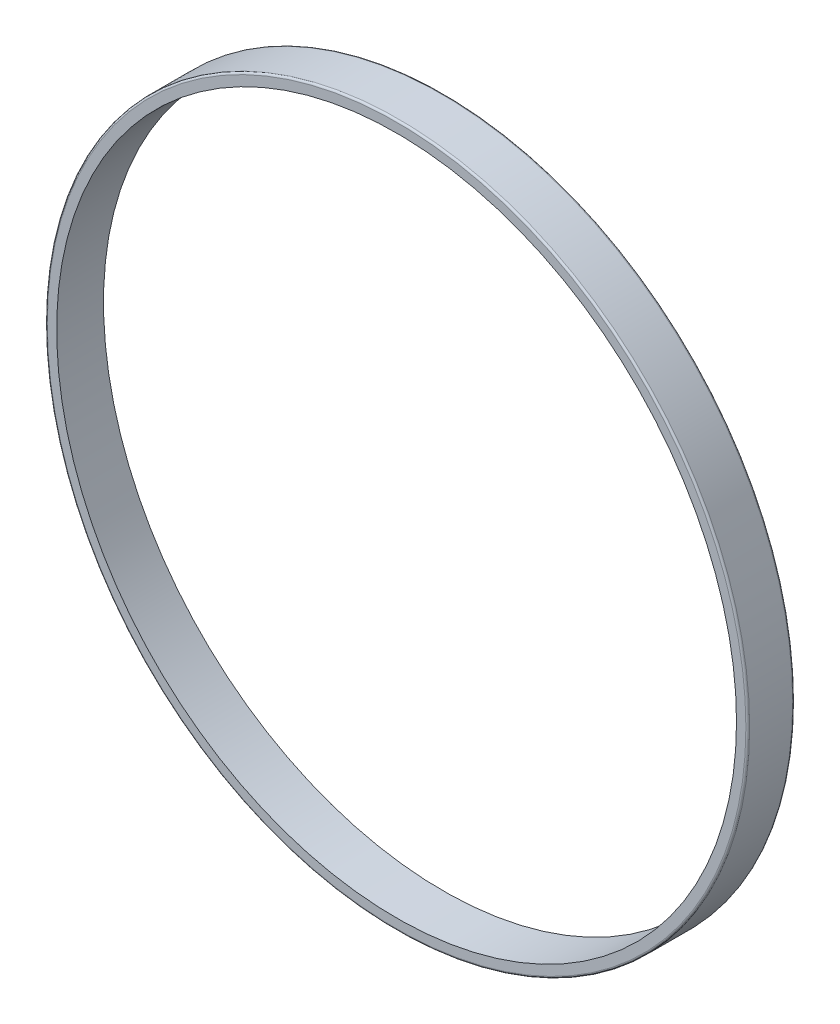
from build123d import *

# Parameters (mm, degrees)
SKETCH_1_R      = 37.5
SKETCH_1_R_2    = 36.3
EXTRUDE_1_DEPTH = 5
FILLET_1_R      = 0.2


with BuildPart() as part:
    # Sketch 1 → Extrude 1 (new body)
    with BuildSketch(Plane.XY):
        Circle(SKETCH_1_R)
        Circle(SKETCH_1_R_2, mode=Mode.SUBTRACT)
    extrude(amount=EXTRUDE_1_DEPTH)

    # Fillet 1
    fillet_1_edges = [part.edges().sort_by_distance(p)[0] for p in [
        (-37.5, 0, 0),
        (-37.5, 0, 5),
    ]]
    fillet(fillet_1_edges, radius=FILLET_1_R)


solid = part.part
